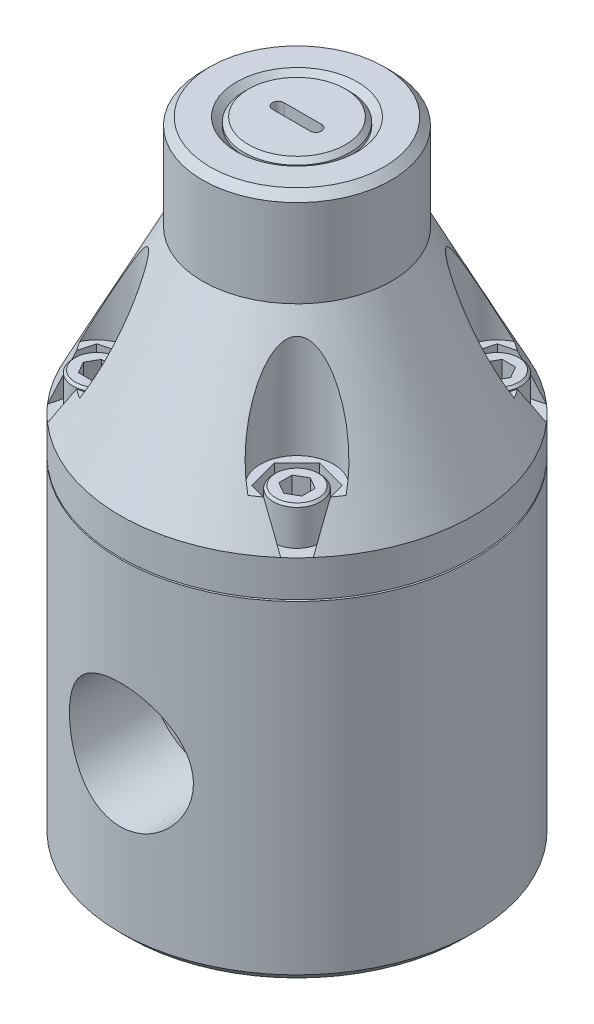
from build123d import *

# Parameters (mm, degrees)
SKETCH1_R         = 29.718
EXTRUDE1_DEPTH    = 105.41
SKETCH3_R         = 10.16
EXTRUDE2_DEPTH    = 1.27
EXTRUDE2_DRAFT    = -45
CIRPATTERN1_COUNT = 2
CHAMFER1_SIZE     = 1.27
CHAMFER2_SIZE     = 1.524
EXTRUDE3_REACH    = 115.479
SKETCH6_R         = 8.89
CHAMFER3_SIZE     = 0.762
EXTRUDE4_DEPTH    = 4.7498
SKETCH8_R         = 6.1722
EXTRUDE5_DEPTH    = 21.0058
CIRPATTERN2_COUNT = 4
EXTRUDE6_DEPTH    = 6.35
CIRPATTERN3_COUNT = 4
SKETCH10_R        = 3.9624
EXTRUDE7_DEPTH    = 6.35
EXTRUDE8_DEPTH    = 3.175
CIRPATTERN4_COUNT = 4
CHAMFER5_SIZE     = 0.381


with BuildPart() as part:
    # Sketch1 → Extrude1 (new body)
    with BuildSketch(Plane(origin=(0, 0, 0), x_dir=(1, 0, 0), z_dir=(0, 1, 0))):
        with Locations(Location((0, 0, 0), (0, 0, 270))):
            Circle(SKETCH1_R)
    extrude(amount=EXTRUDE1_DEPTH)

    # Sketch2 → Cut-Revolve1 (revolve, cut)
    with BuildSketch(Plane.XY, mode=Mode.PRIVATE) as cut_revolve1_sk:
        Polygon((-29.718, 55.88), (-20.625466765, 55.88), (-20.625466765, 56.134), (-29.718, 56.134), (-29.718, 62.23), (-15.875, 89.408), (-15.875, 105.41), (-21.125189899, 108.084162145), (-34.308703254, 108.084162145), (-34.308703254, 59.099585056), align=None)
    revolve(cut_revolve1_sk.sketch.rotate(Axis((0, 0, 0), (0, 1, 0)), 270), axis=Axis((0, 0, 0), (0, 1, 0)), mode=Mode.SUBTRACT)


with BuildPart() as extrude2_tool:
    # Sketch3 → Extrude2 (with draft: the straight prism first)
    with BuildSketch(Plane(origin=(0, 105.41, 0), x_dir=(-1, 0, 0), z_dir=(0, 1, 0))):
        Circle(SKETCH3_R)
    extrude(amount=-EXTRUDE2_DEPTH)
    # Extrude2: the draft: its side faces are tilted about the plane it starts from
    extrude2_sides = [extrude2_tool.faces().sort_by_distance(p)[0] for p in [
        (10.16, 104.775, 0),
    ]]
    draft(extrude2_sides, Plane(origin=(0, 105.41, 0), x_dir=(-1, 0, 0), z_dir=(0, 1, 0)), EXTRUDE2_DRAFT)


with BuildPart() as part_1:
    add(part.part)

    # Extrude2: cut by extrude2_tool
    add(extrude2_tool.part, mode=Mode.SUBTRACT)

    # Sketch5 → 1_2 Rc Tapped Hole1 (revolve, cut)
    with BuildSketch(Plane(origin=(0, 27.432, 29.718), x_dir=(0, -1, 0), z_dir=(1, 0, 0))):
        Polygon((0, 0), (0, 27.754368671), (8.75, 24.13), (8.75, 14.986), (10.009250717, 14.986), (10.477063, 0), align=None)
    f_1_2_rc_tapped_hole1 = revolve(axis=Axis((0, 27.432, 36.068), (0, 0, -1)), mode=Mode.SUBTRACT)

    # CirPattern1: 1_2 Rc Tapped Hole1 ×2 about axis
    cirpattern1_axis = Axis((0, 105.41, 0), (0, -1, 0))
    for i in range(1, CIRPATTERN1_COUNT):
        add(f_1_2_rc_tapped_hole1.rotate(cirpattern1_axis, i * 360 / CIRPATTERN1_COUNT), mode=Mode.SUBTRACT)

    # Chamfer1
    chamfer1_edges = [part_1.edges().sort_by_distance(p)[0] for p in [
        (0, 105.41, 15.875),
    ]]
    chamfer(chamfer1_edges, length=CHAMFER1_SIZE)

    # Chamfer2
    chamfer2_edges = [part_1.edges().sort_by_distance(p)[0] for p in [
        (0, 0, -29.718),
    ]]
    chamfer(chamfer2_edges, length=CHAMFER2_SIZE)

    # Extrude3: up to this cone (the profile starts inside it)
    extrude3_end = Plane(origin=(0, 105.41, 0), z_dir=(0, 1, 0)).offset(-10.159999) * Cone(1e-06, 136.299, 136.298999, align=(Align.CENTER, Align.CENTER, Align.MIN), mode=Mode.PRIVATE)
    # Sketch6 → Extrude3 (add, up to the surface)
    with BuildSketch(Plane(origin=(0, 105.41, 0), x_dir=(-1, 0, 0), z_dir=(0, 1, 0)), mode=Mode.PRIVATE) as extrude3_sk1:
        with Locations(Location((0, 0, 0), (0, 0, 90))):
            Circle(SKETCH6_R)
    extrude3_tool1 = extrude(extrude3_sk1.sketch, amount=-EXTRUDE3_REACH, mode=Mode.PRIVATE) & extrude3_end
    add(extrude3_tool1.solids().sort_by_distance((0, 105.41, 0))[0])

    # Chamfer3
    chamfer3_edges = [part_1.edges().sort_by_distance(p)[0] for p in [
        (0, 105.41, -8.89),
    ]]
    chamfer(chamfer3_edges, length=CHAMFER3_SIZE)

    # Sketch7 → Extrude4 (cut)
    with BuildSketch(Plane(origin=(0, 105.41, 0), x_dir=(-1, 0, 0), z_dir=(0, 1, 0))):
        with BuildLine():
            Line((-3.175, 0.9652), (3.175, 0.9652))
            ThreePointArc((3.175, 0.9652), (4.1402, 0), (3.175, -0.9652))
            Line((3.175, -0.9652), (-3.175, -0.9652))
            ThreePointArc((-3.175, -0.9652), (-4.1402, 0), (-3.175, 0.9652))
        make_face()
    extrude(amount=-EXTRUDE4_DEPTH, mode=Mode.SUBTRACT)

    # Sketch8 → Extrude5 (cut)
    with BuildSketch(Plane(origin=(0, 68.58, 0), x_dir=(-1, 0, 0), z_dir=(0, 1, 0))):
        with Locations((-16.837980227, -16.837980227)):
            Circle(SKETCH8_R)
    extrude5 = extrude(amount=EXTRUDE5_DEPTH, mode=Mode.SUBTRACT)

    # CirPattern2: Extrude5 ×4 about axis
    cirpattern2_axis = Axis((0, 0, 0), (0, 1, 0))
    for i in range(1, CIRPATTERN2_COUNT):
        add(extrude5.rotate(cirpattern2_axis, i * 360 / CIRPATTERN2_COUNT), mode=Mode.SUBTRACT)

    # Sketch9 → Extrude6 (cut)
    with BuildSketch(Plane(origin=(0, 68.58, 0), x_dir=(-1, 0, 0), z_dir=(0, 1, 0))):
        Polygon((-20.633219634, -13.04274082), (-23.297950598, -23.297950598), (-13.04274082, -20.633219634), (-11.653586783, -15.44882619), (-15.44882619, -11.653586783), align=None)
    extrude6 = extrude(amount=-EXTRUDE6_DEPTH, mode=Mode.SUBTRACT)

    # CirPattern3: Extrude6 ×4 about axis
    cirpattern3_axis = Axis((0, 0, 0), (0, 1, 0))
    for i in range(1, CIRPATTERN3_COUNT):
        add(extrude6.rotate(cirpattern3_axis, i * 360 / CIRPATTERN3_COUNT), mode=Mode.SUBTRACT)

    # Sketch10 → Extrude7 (add)
    with BuildSketch(Plane(origin=(0, 68.58, 0), x_dir=(-1, 0, 0), z_dir=(0, 1, 0))):
        with Locations(Location((-16.837980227, -16.837980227, 0), (0, 0, 90))):
            Circle(SKETCH10_R)
    extrude7 = extrude(amount=-EXTRUDE7_DEPTH)

    # Sketch11 → Extrude8 (cut)
    with BuildSketch(Plane(origin=(0, 68.58, 0), x_dir=(-1, 0, 0), z_dir=(0, 1, 0))):
        Polygon((-19.075541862, -16.837980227), (-17.956761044, -18.775765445), (-15.71919941, -18.775765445), (-14.600418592, -16.837980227), (-15.71919941, -14.900195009), (-17.956761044, -14.900195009), align=None)
    extrude8 = extrude(amount=-EXTRUDE8_DEPTH, mode=Mode.SUBTRACT)

    # CirPattern4: Extrude7, Extrude8 ×4 about axis
    cirpattern4_axis = Axis((0, 0, 0), (0, 1, 0))
    add([extrude7.rotate(cirpattern4_axis, i * 360 / CIRPATTERN4_COUNT) for i in range(1, CIRPATTERN4_COUNT)])
    add([extrude8.rotate(cirpattern4_axis, i * 360 / CIRPATTERN4_COUNT) for i in range(1, CIRPATTERN4_COUNT)], mode=Mode.SUBTRACT)

    # Chamfer5
    chamfer5_edges = [part_1.edges().sort_by_distance(p)[0] for p in [
        (16.837980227, 68.58, -20.800380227),
        (20.800380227, 68.58, 16.837980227),
        (-16.837980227, 68.58, 20.800380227),
        (-20.800380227, 68.58, -16.837980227),
    ]]
    chamfer(chamfer5_edges, length=CHAMFER5_SIZE)


solid = part_1.part
